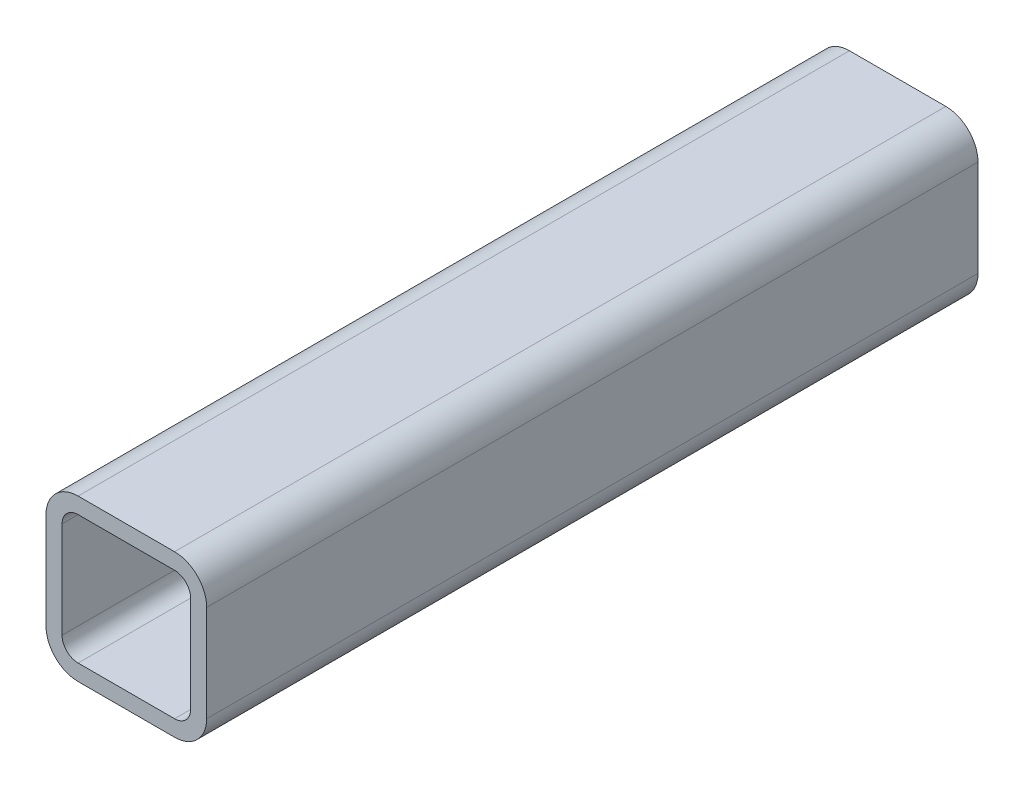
ISO-10303-21;
HEADER;
FILE_DESCRIPTION(('STEP AP214'),'2;1');
FILE_NAME('part.step','',(''),(''),'','','');
FILE_SCHEMA(('AUTOMOTIVE_DESIGN { 1 0 10303 214 1 1 1 1 }'));
ENDSEC;
DATA;
#1=APPLICATION_CONTEXT('core data for automotive mechanical design processes');
#2=APPLICATION_PROTOCOL_DEFINITION('international standard','automotive_design',2000,#1);
#3=PRODUCT_CONTEXT('',#1,'mechanical');
#4=PRODUCT('Part','Part','',(#3));
#5=PRODUCT_RELATED_PRODUCT_CATEGORY('part','',(#4));
#6=PRODUCT_DEFINITION_FORMATION('','',#4);
#7=PRODUCT_DEFINITION_CONTEXT('part definition',#1,'design');
#8=PRODUCT_DEFINITION('design','',#6,#7);
#9=PRODUCT_DEFINITION_SHAPE('','',#8);
#10=(LENGTH_UNIT() NAMED_UNIT(*) SI_UNIT(.MILLI.,.METRE.));
#11=(NAMED_UNIT(*) PLANE_ANGLE_UNIT() SI_UNIT($,.RADIAN.));
#12=(NAMED_UNIT(*) SI_UNIT($,.STERADIAN.) SOLID_ANGLE_UNIT());
#13=UNCERTAINTY_MEASURE_WITH_UNIT(LENGTH_MEASURE(1.E-05),#10,'distance_accuracy_value','');
#14=(GEOMETRIC_REPRESENTATION_CONTEXT(3) GLOBAL_UNCERTAINTY_ASSIGNED_CONTEXT((#13)) GLOBAL_UNIT_ASSIGNED_CONTEXT((#10,
#11,#12)) REPRESENTATION_CONTEXT('',''));
#15=CARTESIAN_POINT('',(0.,0.,0.));
#16=DIRECTION('',(0.,0.,1.));
#17=DIRECTION('',(1.,0.,0.));
#18=AXIS2_PLACEMENT_3D('',#15,#16,#17);
#19=CARTESIAN_POINT('',(15.5960851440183,51.624418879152,304.8));
#20=DIRECTION('',(0.,0.,1.));
#21=DIRECTION('',(1.,0.,0.));
#22=AXIS2_PLACEMENT_3D('',#19,#20,#21);
#23=PLANE('',#22);
#24=CARTESIAN_POINT('',(15.5960851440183,51.624418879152,304.8));
#25=DIRECTION('',(0.,0.,1.));
#26=DIRECTION('',(1.,0.,0.));
#27=AXIS2_PLACEMENT_3D('',#24,#25,#26);
#28=CIRCLE('',#27,12.7);
#29=CARTESIAN_POINT('',(15.5960851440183,64.324418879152,304.8));
#30=VERTEX_POINT('',#29);
#31=CARTESIAN_POINT('',(2.89608514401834,51.624418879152,304.8));
#32=VERTEX_POINT('',#31);
#33=EDGE_CURVE('E211',#30,#32,#28,.T.);
#34=ORIENTED_EDGE('',*,*,#33,.T.);
#35=DIRECTION('',(0.,-1.,0.));
#36=VECTOR('',#35,1.);
#37=CARTESIAN_POINT('',(2.89608514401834,13.524418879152,304.8));
#38=LINE('',#37,#36);
#39=CARTESIAN_POINT('',(2.89608514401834,13.524418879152,304.8));
#40=VERTEX_POINT('',#39);
#41=EDGE_CURVE('E214',#32,#40,#38,.T.);
#42=ORIENTED_EDGE('',*,*,#41,.T.);
#43=CARTESIAN_POINT('',(15.5960851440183,13.524418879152,304.8));
#44=DIRECTION('',(0.,0.,1.));
#45=DIRECTION('',(1.,0.,0.));
#46=AXIS2_PLACEMENT_3D('',#43,#44,#45);
#47=CIRCLE('',#46,12.7);
#48=CARTESIAN_POINT('',(15.5960851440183,0.824418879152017,304.8));
#49=VERTEX_POINT('',#48);
#50=EDGE_CURVE('E217',#40,#49,#47,.T.);
#51=ORIENTED_EDGE('',*,*,#50,.T.);
#52=DIRECTION('',(1.,0.,0.));
#53=VECTOR('',#52,1.);
#54=CARTESIAN_POINT('',(53.6960851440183,0.824418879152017,304.8));
#55=LINE('',#54,#53);
#56=CARTESIAN_POINT('',(53.6960851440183,0.824418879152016,304.8));
#57=VERTEX_POINT('',#56);
#58=EDGE_CURVE('E219',#49,#57,#55,.T.);
#59=ORIENTED_EDGE('',*,*,#58,.T.);
#60=CARTESIAN_POINT('',(53.6960851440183,13.524418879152,304.8));
#61=DIRECTION('',(0.,0.,1.));
#62=DIRECTION('',(1.,0.,0.));
#63=AXIS2_PLACEMENT_3D('',#60,#61,#62);
#64=CIRCLE('',#63,12.7);
#65=CARTESIAN_POINT('',(66.3960851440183,13.524418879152,304.8));
#66=VERTEX_POINT('',#65);
#67=EDGE_CURVE('E221',#57,#66,#64,.T.);
#68=ORIENTED_EDGE('',*,*,#67,.T.);
#69=DIRECTION('',(0.,1.,0.));
#70=VECTOR('',#69,1.);
#71=CARTESIAN_POINT('',(66.3960851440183,51.624418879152,304.8));
#72=LINE('',#71,#70);
#73=CARTESIAN_POINT('',(66.3960851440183,51.624418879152,304.8));
#74=VERTEX_POINT('',#73);
#75=EDGE_CURVE('E223',#66,#74,#72,.T.);
#76=ORIENTED_EDGE('',*,*,#75,.T.);
#77=CARTESIAN_POINT('',(53.6960851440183,51.624418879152,304.8));
#78=DIRECTION('',(0.,0.,1.));
#79=DIRECTION('',(1.,0.,0.));
#80=AXIS2_PLACEMENT_3D('',#77,#78,#79);
#81=CIRCLE('',#80,12.7);
#82=CARTESIAN_POINT('',(53.6960851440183,64.324418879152,304.8));
#83=VERTEX_POINT('',#82);
#84=EDGE_CURVE('E225',#74,#83,#81,.T.);
#85=ORIENTED_EDGE('',*,*,#84,.T.);
#86=DIRECTION('',(-1.,0.,0.));
#87=VECTOR('',#86,1.);
#88=CARTESIAN_POINT('',(15.5960851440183,64.324418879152,304.8));
#89=LINE('',#88,#87);
#90=EDGE_CURVE('E227',#83,#30,#89,.T.);
#91=ORIENTED_EDGE('',*,*,#90,.T.);
#92=EDGE_LOOP('',(#34,#42,#51,#59,#68,#76,#85,#91));
#93=FACE_BOUND('',#92,.T.);
#94=DIRECTION('',(0.,-1.,0.));
#95=VECTOR('',#94,1.);
#96=CARTESIAN_POINT('',(9.24608514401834,13.524418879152,304.8));
#97=LINE('',#96,#95);
#98=CARTESIAN_POINT('',(9.24608514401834,51.624418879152,304.8));
#99=VERTEX_POINT('',#98);
#100=CARTESIAN_POINT('',(9.24608514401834,13.524418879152,304.8));
#101=VERTEX_POINT('',#100);
#102=EDGE_CURVE('E154',#99,#101,#97,.T.);
#103=ORIENTED_EDGE('',*,*,#102,.F.);
#104=CARTESIAN_POINT('',(15.5960851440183,51.624418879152,304.8));
#105=DIRECTION('',(0.,0.,1.));
#106=DIRECTION('',(1.,0.,0.));
#107=AXIS2_PLACEMENT_3D('',#104,#105,#106);
#108=CIRCLE('',#107,6.35000000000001);
#109=CARTESIAN_POINT('',(15.5960851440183,57.974418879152,304.8));
#110=VERTEX_POINT('',#109);
#111=EDGE_CURVE('E146',#110,#99,#108,.T.);
#112=ORIENTED_EDGE('',*,*,#111,.F.);
#113=DIRECTION('',(-1.,0.,0.));
#114=VECTOR('',#113,1.);
#115=CARTESIAN_POINT('',(15.5960851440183,57.974418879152,304.8));
#116=LINE('',#115,#114);
#117=CARTESIAN_POINT('',(53.6960851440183,57.974418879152,304.8));
#118=VERTEX_POINT('',#117);
#119=EDGE_CURVE('E179',#118,#110,#116,.T.);
#120=ORIENTED_EDGE('',*,*,#119,.F.);
#121=CARTESIAN_POINT('',(53.6960851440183,51.624418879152,304.8));
#122=DIRECTION('',(0.,0.,1.));
#123=DIRECTION('',(1.,0.,0.));
#124=AXIS2_PLACEMENT_3D('',#121,#122,#123);
#125=CIRCLE('',#124,6.35000000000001);
#126=CARTESIAN_POINT('',(60.0460851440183,51.624418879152,304.8));
#127=VERTEX_POINT('',#126);
#128=EDGE_CURVE('E177',#127,#118,#125,.T.);
#129=ORIENTED_EDGE('',*,*,#128,.F.);
#130=DIRECTION('',(0.,1.,0.));
#131=VECTOR('',#130,1.);
#132=CARTESIAN_POINT('',(60.0460851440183,51.624418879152,304.8));
#133=LINE('',#132,#131);
#134=CARTESIAN_POINT('',(60.0460851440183,13.524418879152,304.8));
#135=VERTEX_POINT('',#134);
#136=EDGE_CURVE('E175',#135,#127,#133,.T.);
#137=ORIENTED_EDGE('',*,*,#136,.F.);
#138=CARTESIAN_POINT('',(53.6960851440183,13.524418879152,304.8));
#139=DIRECTION('',(0.,0.,1.));
#140=DIRECTION('',(1.,0.,0.));
#141=AXIS2_PLACEMENT_3D('',#138,#139,#140);
#142=CIRCLE('',#141,6.35000000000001);
#143=CARTESIAN_POINT('',(53.6960851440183,7.17441887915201,304.8));
#144=VERTEX_POINT('',#143);
#145=EDGE_CURVE('E173',#144,#135,#142,.T.);
#146=ORIENTED_EDGE('',*,*,#145,.F.);
#147=DIRECTION('',(1.,0.,0.));
#148=VECTOR('',#147,1.);
#149=CARTESIAN_POINT('',(53.6960851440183,7.17441887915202,304.8));
#150=LINE('',#149,#148);
#151=CARTESIAN_POINT('',(15.5960851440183,7.17441887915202,304.8));
#152=VERTEX_POINT('',#151);
#153=EDGE_CURVE('E169',#152,#144,#150,.T.);
#154=ORIENTED_EDGE('',*,*,#153,.F.);
#155=CARTESIAN_POINT('',(15.5960851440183,13.524418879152,304.8));
#156=DIRECTION('',(0.,0.,1.));
#157=DIRECTION('',(1.,0.,0.));
#158=AXIS2_PLACEMENT_3D('',#155,#156,#157);
#159=CIRCLE('',#158,6.35);
#160=EDGE_CURVE('E167',#101,#152,#159,.T.);
#161=ORIENTED_EDGE('',*,*,#160,.F.);
#162=EDGE_LOOP('',(#103,#112,#120,#129,#137,#146,#154,#161));
#163=FACE_BOUND('',#162,.T.);
#164=ADVANCED_FACE('F33',(#93,#163),#23,.T.);
#165=CARTESIAN_POINT('',(15.5960851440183,51.624418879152,0.));
#166=DIRECTION('',(0.,0.,1.));
#167=DIRECTION('',(1.,0.,0.));
#168=AXIS2_PLACEMENT_3D('',#165,#166,#167);
#169=PLANE('',#168);
#170=CARTESIAN_POINT('',(15.5960851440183,51.624418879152,0.));
#171=DIRECTION('',(0.,0.,1.));
#172=DIRECTION('',(1.,0.,0.));
#173=AXIS2_PLACEMENT_3D('',#170,#171,#172);
#174=CIRCLE('',#173,12.7);
#175=CARTESIAN_POINT('',(15.5960851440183,64.324418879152,0.));
#176=VERTEX_POINT('',#175);
#177=CARTESIAN_POINT('',(2.89608514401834,51.624418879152,0.));
#178=VERTEX_POINT('',#177);
#179=EDGE_CURVE('E162',#176,#178,#174,.T.);
#180=ORIENTED_EDGE('',*,*,#179,.F.);
#181=DIRECTION('',(-1.,0.,0.));
#182=VECTOR('',#181,1.);
#183=CARTESIAN_POINT('',(15.5960851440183,64.324418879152,0.));
#184=LINE('',#183,#182);
#185=CARTESIAN_POINT('',(53.6960851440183,64.324418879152,0.));
#186=VERTEX_POINT('',#185);
#187=EDGE_CURVE('E215',#186,#176,#184,.T.);
#188=ORIENTED_EDGE('',*,*,#187,.F.);
#189=CARTESIAN_POINT('',(53.6960851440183,51.624418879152,0.));
#190=DIRECTION('',(0.,0.,1.));
#191=DIRECTION('',(1.,0.,0.));
#192=AXIS2_PLACEMENT_3D('',#189,#190,#191);
#193=CIRCLE('',#192,12.7);
#194=CARTESIAN_POINT('',(66.3960851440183,51.624418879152,0.));
#195=VERTEX_POINT('',#194);
#196=EDGE_CURVE('E242',#195,#186,#193,.T.);
#197=ORIENTED_EDGE('',*,*,#196,.F.);
#198=DIRECTION('',(0.,1.,0.));
#199=VECTOR('',#198,1.);
#200=CARTESIAN_POINT('',(66.3960851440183,51.624418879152,0.));
#201=LINE('',#200,#199);
#202=CARTESIAN_POINT('',(66.3960851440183,13.524418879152,0.));
#203=VERTEX_POINT('',#202);
#204=EDGE_CURVE('E240',#203,#195,#201,.T.);
#205=ORIENTED_EDGE('',*,*,#204,.F.);
#206=CARTESIAN_POINT('',(53.6960851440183,13.524418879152,0.));
#207=DIRECTION('',(0.,0.,1.));
#208=DIRECTION('',(1.,0.,0.));
#209=AXIS2_PLACEMENT_3D('',#206,#207,#208);
#210=CIRCLE('',#209,12.7);
#211=CARTESIAN_POINT('',(53.6960851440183,0.824418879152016,0.));
#212=VERTEX_POINT('',#211);
#213=EDGE_CURVE('E238',#212,#203,#210,.T.);
#214=ORIENTED_EDGE('',*,*,#213,.F.);
#215=DIRECTION('',(1.,0.,0.));
#216=VECTOR('',#215,1.);
#217=CARTESIAN_POINT('',(53.6960851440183,0.824418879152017,0.));
#218=LINE('',#217,#216);
#219=CARTESIAN_POINT('',(15.5960851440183,0.824418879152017,0.));
#220=VERTEX_POINT('',#219);
#221=EDGE_CURVE('E236',#220,#212,#218,.T.);
#222=ORIENTED_EDGE('',*,*,#221,.F.);
#223=CARTESIAN_POINT('',(15.5960851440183,13.524418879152,0.));
#224=DIRECTION('',(0.,0.,1.));
#225=DIRECTION('',(1.,0.,0.));
#226=AXIS2_PLACEMENT_3D('',#223,#224,#225);
#227=CIRCLE('',#226,12.7);
#228=CARTESIAN_POINT('',(2.89608514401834,13.524418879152,0.));
#229=VERTEX_POINT('',#228);
#230=EDGE_CURVE('E234',#229,#220,#227,.T.);
#231=ORIENTED_EDGE('',*,*,#230,.F.);
#232=DIRECTION('',(0.,-1.,0.));
#233=VECTOR('',#232,1.);
#234=CARTESIAN_POINT('',(2.89608514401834,13.524418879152,0.));
#235=LINE('',#234,#233);
#236=EDGE_CURVE('E232',#178,#229,#235,.T.);
#237=ORIENTED_EDGE('',*,*,#236,.F.);
#238=EDGE_LOOP('',(#180,#188,#197,#205,#214,#222,#231,#237));
#239=FACE_BOUND('',#238,.T.);
#240=CARTESIAN_POINT('',(15.5960851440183,51.624418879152,0.));
#241=DIRECTION('',(0.,0.,1.));
#242=DIRECTION('',(1.,0.,0.));
#243=AXIS2_PLACEMENT_3D('',#240,#241,#242);
#244=CIRCLE('',#243,6.35000000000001);
#245=CARTESIAN_POINT('',(15.5960851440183,57.974418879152,0.));
#246=VERTEX_POINT('',#245);
#247=CARTESIAN_POINT('',(9.24608514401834,51.624418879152,0.));
#248=VERTEX_POINT('',#247);
#249=EDGE_CURVE('E56',#246,#248,#244,.T.);
#250=ORIENTED_EDGE('',*,*,#249,.T.);
#251=DIRECTION('',(0.,-1.,0.));
#252=VECTOR('',#251,1.);
#253=CARTESIAN_POINT('',(9.24608514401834,13.524418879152,0.));
#254=LINE('',#253,#252);
#255=CARTESIAN_POINT('',(9.24608514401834,13.524418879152,0.));
#256=VERTEX_POINT('',#255);
#257=EDGE_CURVE('E161',#248,#256,#254,.T.);
#258=ORIENTED_EDGE('',*,*,#257,.T.);
#259=CARTESIAN_POINT('',(15.5960851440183,13.524418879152,0.));
#260=DIRECTION('',(0.,0.,1.));
#261=DIRECTION('',(1.,0.,0.));
#262=AXIS2_PLACEMENT_3D('',#259,#260,#261);
#263=CIRCLE('',#262,6.35);
#264=CARTESIAN_POINT('',(15.5960851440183,7.17441887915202,0.));
#265=VERTEX_POINT('',#264);
#266=EDGE_CURVE('E183',#256,#265,#263,.T.);
#267=ORIENTED_EDGE('',*,*,#266,.T.);
#268=DIRECTION('',(1.,0.,0.));
#269=VECTOR('',#268,1.);
#270=CARTESIAN_POINT('',(53.6960851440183,7.17441887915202,0.));
#271=LINE('',#270,#269);
#272=CARTESIAN_POINT('',(53.6960851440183,7.17441887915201,0.));
#273=VERTEX_POINT('',#272);
#274=EDGE_CURVE('E186',#265,#273,#271,.T.);
#275=ORIENTED_EDGE('',*,*,#274,.T.);
#276=CARTESIAN_POINT('',(53.6960851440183,13.524418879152,0.));
#277=DIRECTION('',(0.,0.,1.));
#278=DIRECTION('',(1.,0.,0.));
#279=AXIS2_PLACEMENT_3D('',#276,#277,#278);
#280=CIRCLE('',#279,6.35000000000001);
#281=CARTESIAN_POINT('',(60.0460851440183,13.524418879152,0.));
#282=VERTEX_POINT('',#281);
#283=EDGE_CURVE('E189',#273,#282,#280,.T.);
#284=ORIENTED_EDGE('',*,*,#283,.T.);
#285=DIRECTION('',(0.,1.,0.));
#286=VECTOR('',#285,1.);
#287=CARTESIAN_POINT('',(60.0460851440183,51.624418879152,0.));
#288=LINE('',#287,#286);
#289=CARTESIAN_POINT('',(60.0460851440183,51.624418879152,0.));
#290=VERTEX_POINT('',#289);
#291=EDGE_CURVE('E192',#282,#290,#288,.T.);
#292=ORIENTED_EDGE('',*,*,#291,.T.);
#293=CARTESIAN_POINT('',(53.6960851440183,51.624418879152,0.));
#294=DIRECTION('',(0.,0.,1.));
#295=DIRECTION('',(1.,0.,0.));
#296=AXIS2_PLACEMENT_3D('',#293,#294,#295);
#297=CIRCLE('',#296,6.35000000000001);
#298=CARTESIAN_POINT('',(53.6960851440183,57.974418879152,0.));
#299=VERTEX_POINT('',#298);
#300=EDGE_CURVE('E195',#290,#299,#297,.T.);
#301=ORIENTED_EDGE('',*,*,#300,.T.);
#302=DIRECTION('',(-1.,0.,0.));
#303=VECTOR('',#302,1.);
#304=CARTESIAN_POINT('',(15.5960851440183,57.974418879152,0.));
#305=LINE('',#304,#303);
#306=EDGE_CURVE('E155',#299,#246,#305,.T.);
#307=ORIENTED_EDGE('',*,*,#306,.T.);
#308=EDGE_LOOP('',(#250,#258,#267,#275,#284,#292,#301,#307));
#309=FACE_BOUND('',#308,.T.);
#310=ADVANCED_FACE('F272',(#239,#309),#169,.F.);
#311=CARTESIAN_POINT('',(15.5960851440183,51.624418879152,304.8));
#312=DIRECTION('',(0.,0.,-1.));
#313=DIRECTION('',(-1.,0.,0.));
#314=AXIS2_PLACEMENT_3D('',#311,#312,#313);
#315=CYLINDRICAL_SURFACE('',#314,12.7);
#316=ORIENTED_EDGE('',*,*,#179,.T.);
#317=DIRECTION('',(0.,0.,-1.));
#318=VECTOR('',#317,1.);
#319=CARTESIAN_POINT('',(2.89608514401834,51.624418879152,304.8));
#320=LINE('',#319,#318);
#321=EDGE_CURVE('E11',#32,#178,#320,.T.);
#322=ORIENTED_EDGE('',*,*,#321,.F.);
#323=ORIENTED_EDGE('',*,*,#33,.F.);
#324=DIRECTION('',(0.,0.,-1.));
#325=VECTOR('',#324,1.);
#326=CARTESIAN_POINT('',(15.5960851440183,64.324418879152,304.8));
#327=LINE('',#326,#325);
#328=EDGE_CURVE('E229',#30,#176,#327,.T.);
#329=ORIENTED_EDGE('',*,*,#328,.T.);
#330=EDGE_LOOP('',(#316,#322,#323,#329));
#331=FACE_BOUND('',#330,.T.);
#332=ADVANCED_FACE('F35',(#331),#315,.T.);
#333=CARTESIAN_POINT('',(2.89608514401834,13.524418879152,304.8));
#334=DIRECTION('',(1.,0.,0.));
#335=DIRECTION('',(0.,0.,-1.));
#336=AXIS2_PLACEMENT_3D('',#333,#334,#335);
#337=PLANE('',#336);
#338=ORIENTED_EDGE('',*,*,#236,.T.);
#339=DIRECTION('',(0.,0.,-1.));
#340=VECTOR('',#339,1.);
#341=CARTESIAN_POINT('',(2.89608514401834,13.524418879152,304.8));
#342=LINE('',#341,#340);
#343=EDGE_CURVE('E41',#40,#229,#342,.T.);
#344=ORIENTED_EDGE('',*,*,#343,.F.);
#345=ORIENTED_EDGE('',*,*,#41,.F.);
#346=ORIENTED_EDGE('',*,*,#321,.T.);
#347=EDGE_LOOP('',(#338,#344,#345,#346));
#348=FACE_BOUND('',#347,.T.);
#349=ADVANCED_FACE('F289',(#348),#337,.F.);
#350=CARTESIAN_POINT('',(15.5960851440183,13.524418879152,304.8));
#351=DIRECTION('',(0.,0.,-1.));
#352=DIRECTION('',(-1.,0.,0.));
#353=AXIS2_PLACEMENT_3D('',#350,#351,#352);
#354=CYLINDRICAL_SURFACE('',#353,12.7);
#355=ORIENTED_EDGE('',*,*,#230,.T.);
#356=DIRECTION('',(0.,0.,-1.));
#357=VECTOR('',#356,1.);
#358=CARTESIAN_POINT('',(15.5960851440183,0.824418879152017,304.8));
#359=LINE('',#358,#357);
#360=EDGE_CURVE('E259',#49,#220,#359,.T.);
#361=ORIENTED_EDGE('',*,*,#360,.F.);
#362=ORIENTED_EDGE('',*,*,#50,.F.);
#363=ORIENTED_EDGE('',*,*,#343,.T.);
#364=EDGE_LOOP('',(#355,#361,#362,#363));
#365=FACE_BOUND('',#364,.T.);
#366=ADVANCED_FACE('F266',(#365),#354,.T.);
#367=CARTESIAN_POINT('',(53.6960851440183,0.824418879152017,304.8));
#368=DIRECTION('',(0.,1.,0.));
#369=DIRECTION('',(0.,0.,1.));
#370=AXIS2_PLACEMENT_3D('',#367,#368,#369);
#371=PLANE('',#370);
#372=ORIENTED_EDGE('',*,*,#221,.T.);
#373=DIRECTION('',(0.,0.,-1.));
#374=VECTOR('',#373,1.);
#375=CARTESIAN_POINT('',(53.6960851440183,0.824418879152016,304.8));
#376=LINE('',#375,#374);
#377=EDGE_CURVE('E256',#57,#212,#376,.T.);
#378=ORIENTED_EDGE('',*,*,#377,.F.);
#379=ORIENTED_EDGE('',*,*,#58,.F.);
#380=ORIENTED_EDGE('',*,*,#360,.T.);
#381=EDGE_LOOP('',(#372,#378,#379,#380));
#382=FACE_BOUND('',#381,.T.);
#383=ADVANCED_FACE('F278',(#382),#371,.F.);
#384=CARTESIAN_POINT('',(53.6960851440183,13.524418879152,304.8));
#385=DIRECTION('',(0.,0.,-1.));
#386=DIRECTION('',(-1.,0.,0.));
#387=AXIS2_PLACEMENT_3D('',#384,#385,#386);
#388=CYLINDRICAL_SURFACE('',#387,12.7);
#389=ORIENTED_EDGE('',*,*,#213,.T.);
#390=DIRECTION('',(0.,0.,-1.));
#391=VECTOR('',#390,1.);
#392=CARTESIAN_POINT('',(66.3960851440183,13.524418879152,304.8));
#393=LINE('',#392,#391);
#394=EDGE_CURVE('E253',#66,#203,#393,.T.);
#395=ORIENTED_EDGE('',*,*,#394,.F.);
#396=ORIENTED_EDGE('',*,*,#67,.F.);
#397=ORIENTED_EDGE('',*,*,#377,.T.);
#398=EDGE_LOOP('',(#389,#395,#396,#397));
#399=FACE_BOUND('',#398,.T.);
#400=ADVANCED_FACE('F282',(#399),#388,.T.);
#401=CARTESIAN_POINT('',(66.3960851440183,51.624418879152,304.8));
#402=DIRECTION('',(-1.,0.,0.));
#403=DIRECTION('',(0.,0.,1.));
#404=AXIS2_PLACEMENT_3D('',#401,#402,#403);
#405=PLANE('',#404);
#406=ORIENTED_EDGE('',*,*,#204,.T.);
#407=DIRECTION('',(0.,0.,-1.));
#408=VECTOR('',#407,1.);
#409=CARTESIAN_POINT('',(66.3960851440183,51.624418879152,304.8));
#410=LINE('',#409,#408);
#411=EDGE_CURVE('E250',#74,#195,#410,.T.);
#412=ORIENTED_EDGE('',*,*,#411,.F.);
#413=ORIENTED_EDGE('',*,*,#75,.F.);
#414=ORIENTED_EDGE('',*,*,#394,.T.);
#415=EDGE_LOOP('',(#406,#412,#413,#414));
#416=FACE_BOUND('',#415,.T.);
#417=ADVANCED_FACE('F302',(#416),#405,.F.);
#418=CARTESIAN_POINT('',(53.6960851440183,51.624418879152,304.8));
#419=DIRECTION('',(0.,0.,-1.));
#420=DIRECTION('',(-1.,0.,0.));
#421=AXIS2_PLACEMENT_3D('',#418,#419,#420);
#422=CYLINDRICAL_SURFACE('',#421,12.7);
#423=ORIENTED_EDGE('',*,*,#196,.T.);
#424=DIRECTION('',(0.,0.,-1.));
#425=VECTOR('',#424,1.);
#426=CARTESIAN_POINT('',(53.6960851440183,64.324418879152,304.8));
#427=LINE('',#426,#425);
#428=EDGE_CURVE('E247',#83,#186,#427,.T.);
#429=ORIENTED_EDGE('',*,*,#428,.F.);
#430=ORIENTED_EDGE('',*,*,#84,.F.);
#431=ORIENTED_EDGE('',*,*,#411,.T.);
#432=EDGE_LOOP('',(#423,#429,#430,#431));
#433=FACE_BOUND('',#432,.T.);
#434=ADVANCED_FACE('F300',(#433),#422,.T.);
#435=CARTESIAN_POINT('',(15.5960851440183,64.324418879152,304.8));
#436=DIRECTION('',(0.,-1.,0.));
#437=DIRECTION('',(0.,0.,-1.));
#438=AXIS2_PLACEMENT_3D('',#435,#436,#437);
#439=PLANE('',#438);
#440=ORIENTED_EDGE('',*,*,#187,.T.);
#441=ORIENTED_EDGE('',*,*,#328,.F.);
#442=ORIENTED_EDGE('',*,*,#90,.F.);
#443=ORIENTED_EDGE('',*,*,#428,.T.);
#444=EDGE_LOOP('',(#440,#441,#442,#443));
#445=FACE_BOUND('',#444,.T.);
#446=ADVANCED_FACE('F295',(#445),#439,.F.);
#447=CARTESIAN_POINT('',(15.5960851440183,51.624418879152,304.8));
#448=DIRECTION('',(0.,0.,-1.));
#449=DIRECTION('',(-1.,0.,0.));
#450=AXIS2_PLACEMENT_3D('',#447,#448,#449);
#451=CYLINDRICAL_SURFACE('',#450,6.35000000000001);
#452=ORIENTED_EDGE('',*,*,#249,.F.);
#453=DIRECTION('',(0.,0.,-1.));
#454=VECTOR('',#453,1.);
#455=CARTESIAN_POINT('',(15.5960851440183,57.974418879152,304.8));
#456=LINE('',#455,#454);
#457=EDGE_CURVE('E150',#110,#246,#456,.T.);
#458=ORIENTED_EDGE('',*,*,#457,.F.);
#459=ORIENTED_EDGE('',*,*,#111,.T.);
#460=DIRECTION('',(0.,0.,-1.));
#461=VECTOR('',#460,1.);
#462=CARTESIAN_POINT('',(9.24608514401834,51.624418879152,304.8));
#463=LINE('',#462,#461);
#464=EDGE_CURVE('E149',#99,#248,#463,.T.);
#465=ORIENTED_EDGE('',*,*,#464,.T.);
#466=EDGE_LOOP('',(#452,#458,#459,#465));
#467=FACE_BOUND('',#466,.T.);
#468=ADVANCED_FACE('F148',(#467),#451,.F.);
#469=CARTESIAN_POINT('',(9.24608514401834,13.524418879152,304.8));
#470=DIRECTION('',(1.,0.,0.));
#471=DIRECTION('',(0.,0.,-1.));
#472=AXIS2_PLACEMENT_3D('',#469,#470,#471);
#473=PLANE('',#472);
#474=ORIENTED_EDGE('',*,*,#257,.F.);
#475=ORIENTED_EDGE('',*,*,#464,.F.);
#476=ORIENTED_EDGE('',*,*,#102,.T.);
#477=DIRECTION('',(0.,0.,-1.));
#478=VECTOR('',#477,1.);
#479=CARTESIAN_POINT('',(9.24608514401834,13.524418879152,304.8));
#480=LINE('',#479,#478);
#481=EDGE_CURVE('E163',#101,#256,#480,.T.);
#482=ORIENTED_EDGE('',*,*,#481,.T.);
#483=EDGE_LOOP('',(#474,#475,#476,#482));
#484=FACE_BOUND('',#483,.T.);
#485=ADVANCED_FACE('F158',(#484),#473,.T.);
#486=CARTESIAN_POINT('',(15.5960851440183,13.524418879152,304.8));
#487=DIRECTION('',(0.,0.,-1.));
#488=DIRECTION('',(-1.,0.,0.));
#489=AXIS2_PLACEMENT_3D('',#486,#487,#488);
#490=CYLINDRICAL_SURFACE('',#489,6.35);
#491=ORIENTED_EDGE('',*,*,#266,.F.);
#492=ORIENTED_EDGE('',*,*,#481,.F.);
#493=ORIENTED_EDGE('',*,*,#160,.T.);
#494=DIRECTION('',(0.,0.,-1.));
#495=VECTOR('',#494,1.);
#496=CARTESIAN_POINT('',(15.5960851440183,7.17441887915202,304.8));
#497=LINE('',#496,#495);
#498=EDGE_CURVE('E208',#152,#265,#497,.T.);
#499=ORIENTED_EDGE('',*,*,#498,.T.);
#500=EDGE_LOOP('',(#491,#492,#493,#499));
#501=FACE_BOUND('',#500,.T.);
#502=ADVANCED_FACE('F327',(#501),#490,.F.);
#503=CARTESIAN_POINT('',(53.6960851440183,7.17441887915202,304.8));
#504=DIRECTION('',(0.,1.,0.));
#505=DIRECTION('',(0.,0.,1.));
#506=AXIS2_PLACEMENT_3D('',#503,#504,#505);
#507=PLANE('',#506);
#508=ORIENTED_EDGE('',*,*,#274,.F.);
#509=ORIENTED_EDGE('',*,*,#498,.F.);
#510=ORIENTED_EDGE('',*,*,#153,.T.);
#511=DIRECTION('',(0.,0.,-1.));
#512=VECTOR('',#511,1.);
#513=CARTESIAN_POINT('',(53.6960851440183,7.17441887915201,304.8));
#514=LINE('',#513,#512);
#515=EDGE_CURVE('E206',#144,#273,#514,.T.);
#516=ORIENTED_EDGE('',*,*,#515,.T.);
#517=EDGE_LOOP('',(#508,#509,#510,#516));
#518=FACE_BOUND('',#517,.T.);
#519=ADVANCED_FACE('F331',(#518),#507,.T.);
#520=CARTESIAN_POINT('',(53.6960851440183,13.524418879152,304.8));
#521=DIRECTION('',(0.,0.,-1.));
#522=DIRECTION('',(-1.,0.,0.));
#523=AXIS2_PLACEMENT_3D('',#520,#521,#522);
#524=CYLINDRICAL_SURFACE('',#523,6.35000000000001);
#525=ORIENTED_EDGE('',*,*,#283,.F.);
#526=ORIENTED_EDGE('',*,*,#515,.F.);
#527=ORIENTED_EDGE('',*,*,#145,.T.);
#528=DIRECTION('',(0.,0.,-1.));
#529=VECTOR('',#528,1.);
#530=CARTESIAN_POINT('',(60.0460851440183,13.524418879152,304.8));
#531=LINE('',#530,#529);
#532=EDGE_CURVE('E204',#135,#282,#531,.T.);
#533=ORIENTED_EDGE('',*,*,#532,.T.);
#534=EDGE_LOOP('',(#525,#526,#527,#533));
#535=FACE_BOUND('',#534,.T.);
#536=ADVANCED_FACE('F337',(#535),#524,.F.);
#537=CARTESIAN_POINT('',(60.0460851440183,51.624418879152,304.8));
#538=DIRECTION('',(-1.,0.,0.));
#539=DIRECTION('',(0.,0.,1.));
#540=AXIS2_PLACEMENT_3D('',#537,#538,#539);
#541=PLANE('',#540);
#542=ORIENTED_EDGE('',*,*,#291,.F.);
#543=ORIENTED_EDGE('',*,*,#532,.F.);
#544=ORIENTED_EDGE('',*,*,#136,.T.);
#545=DIRECTION('',(0.,0.,-1.));
#546=VECTOR('',#545,1.);
#547=CARTESIAN_POINT('',(60.0460851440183,51.624418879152,304.8));
#548=LINE('',#547,#546);
#549=EDGE_CURVE('E202',#127,#290,#548,.T.);
#550=ORIENTED_EDGE('',*,*,#549,.T.);
#551=EDGE_LOOP('',(#542,#543,#544,#550));
#552=FACE_BOUND('',#551,.T.);
#553=ADVANCED_FACE('F341',(#552),#541,.T.);
#554=CARTESIAN_POINT('',(53.6960851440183,51.624418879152,304.8));
#555=DIRECTION('',(0.,0.,-1.));
#556=DIRECTION('',(-1.,0.,0.));
#557=AXIS2_PLACEMENT_3D('',#554,#555,#556);
#558=CYLINDRICAL_SURFACE('',#557,6.35000000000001);
#559=ORIENTED_EDGE('',*,*,#300,.F.);
#560=ORIENTED_EDGE('',*,*,#549,.F.);
#561=ORIENTED_EDGE('',*,*,#128,.T.);
#562=DIRECTION('',(0.,0.,-1.));
#563=VECTOR('',#562,1.);
#564=CARTESIAN_POINT('',(53.6960851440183,57.974418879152,304.8));
#565=LINE('',#564,#563);
#566=EDGE_CURVE('E48',#118,#299,#565,.T.);
#567=ORIENTED_EDGE('',*,*,#566,.T.);
#568=EDGE_LOOP('',(#559,#560,#561,#567));
#569=FACE_BOUND('',#568,.T.);
#570=ADVANCED_FACE('F345',(#569),#558,.F.);
#571=CARTESIAN_POINT('',(15.5960851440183,57.974418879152,304.8));
#572=DIRECTION('',(0.,-1.,0.));
#573=DIRECTION('',(0.,0.,-1.));
#574=AXIS2_PLACEMENT_3D('',#571,#572,#573);
#575=PLANE('',#574);
#576=ORIENTED_EDGE('',*,*,#306,.F.);
#577=ORIENTED_EDGE('',*,*,#566,.F.);
#578=ORIENTED_EDGE('',*,*,#119,.T.);
#579=ORIENTED_EDGE('',*,*,#457,.T.);
#580=EDGE_LOOP('',(#576,#577,#578,#579));
#581=FACE_BOUND('',#580,.T.);
#582=ADVANCED_FACE('F349',(#581),#575,.T.);
#583=CLOSED_SHELL('',(#164,#310,#332,#349,#366,#383,#400,#417,#434,#446,#468,#485,#502,#519,
#536,#553,#570,#582));
#584=MANIFOLD_SOLID_BREP('B2',#583);
#585=ADVANCED_BREP_SHAPE_REPRESENTATION('',(#18,#584),#14);
#586=SHAPE_DEFINITION_REPRESENTATION(#9,#585);
ENDSEC;
END-ISO-10303-21;
